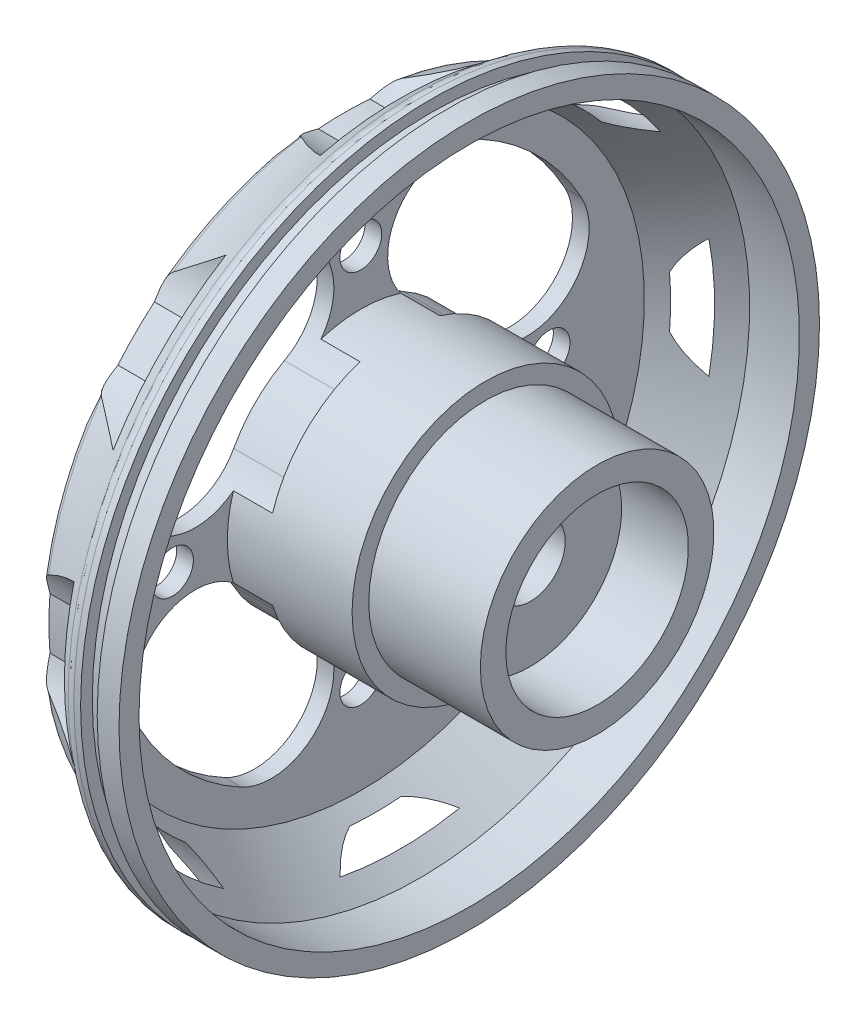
from build123d import *

# Parameters (mm, degrees)
FILLET1_R          = 1
CUT_EXTRUDE2_START = -4
CUT_EXTRUDE2_DEPTH = 4
SKETCH3_R          = 1.5
CUT_EXTRUDE3_DEPTH = 4


with BuildPart() as part:
    # Sketch1 → Revolve1 (revolve)
    with BuildSketch(Plane.XY, mode=Mode.PRIVATE) as revolve1_sk:
        with BuildLine():
            Line((13.355, 6.545), (13.355, 2.5))
            Line((13.355, 2.5), (4.784, 2.5))
            Line((4.784, 2.5), (4.784, 6.545))
            Line((4.784, 6.545), (0, 6.545))
            Line((0, 6.545), (0, 21.81504))
            ThreePointArc((0, 21.81504), (2.810772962, 23.266882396), (5.382, 25.11))
            Line((5.382, 25.11), (6.2192, 25.11))
            Line((6.2192, 25.11), (6.2192, 24.2728))
            Line((6.2192, 24.2728), (7.4092, 24.2728))
            Line((7.4092, 24.2728), (7.4092, 25.11))
            Line((7.4092, 25.11), (8.97, 25.11))
            Line((8.97, 25.11), (8.97, 23.6748))
            Line((8.97, 23.6748), (5.4, 23.6748))
            Line((5.4, 23.6748), (1.196, 20.332))
            Line((1.196, 20.332), (1.196, 9.568))
            Line((1.196, 9.568), (10.139, 9.568))
            Line((10.139, 9.568), (10.139, 8.372))
            Line((10.139, 8.372), (18.139, 8.372))
            Line((18.139, 8.372), (18.139, 6.545))
            Line((18.139, 6.545), (13.355, 6.545))
        make_face()
    revolve(revolve1_sk.sketch.rotate(Axis((0, 0, 0), (1, 0, 0)), 90), axis=Axis((0, 0, 0), (1, 0, 0)))

    # Fillet1
    fillet1_edges = [part.edges().sort_by_distance(p)[0] for p in [
        (5.382, 0, -25.11),
        (0, 0, -21.81504),
    ]]
    fillet(fillet1_edges, radius=FILLET1_R)

    # Sketch2 → Cut-Extrude2 (cut)
    with BuildSketch(Plane.ZY.offset(CUT_EXTRUDE2_START)):
        with BuildLine():
            ThreePointArc((-13.601152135, 16.217092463), (-12.594280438, 18.874157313), (-12.607387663, 21.715567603))
            ThreePointArc((-12.607387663, 21.715567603), (-17.755451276, 17.755451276), (-21.715567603, 12.607387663))
            ThreePointArc((-21.715567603, 12.607387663), (-18.874157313, 12.594280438), (-16.217092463, 13.601152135))
            ThreePointArc((-16.217092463, 13.601152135), (-14.966386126, 14.966386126), (-13.601152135, 16.217092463))
        make_face()
        with BuildLine():
            ThreePointArc((1.849749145, 21.084682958), (4.440543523, 22.251545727), (6.4404558, 24.269994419))
            ThreePointArc((6.4404558, 24.269994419), (0, 25.11), (-6.4404558, 24.269994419))
            ThreePointArc((-6.4404558, 24.269994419), (-4.440543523, 22.251545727), (-1.849749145, 21.084682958))
            ThreePointArc((-1.849749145, 21.084682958), (0, 21.165666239), (1.849749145, 21.084682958))
        make_face()
        with BuildLine():
            ThreePointArc((21.715567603, 12.607387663), (17.755451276, 17.755451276), (12.607387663, 21.715567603))
            ThreePointArc((12.607387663, 21.715567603), (12.594280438, 18.874157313), (13.601152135, 16.217092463))
            ThreePointArc((13.601152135, 16.217092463), (14.966386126, 14.966386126), (16.217092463, 13.601152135))
            ThreePointArc((16.217092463, 13.601152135), (18.874157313, 12.594280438), (21.715567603, 12.607387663))
        make_face()
        with BuildLine():
            ThreePointArc((25.11, 0), (24.899113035, 3.247502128), (24.269994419, 6.4404558))
            ThreePointArc((24.269994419, 6.4404558), (22.251545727, 4.440543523), (21.084682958, 1.849749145))
            ThreePointArc((21.084682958, 1.849749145), (21.145410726, 0.925760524), (21.165666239, 0))
            ThreePointArc((21.165666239, 0), (21.145410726, -0.925760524), (21.084682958, -1.849749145))
            ThreePointArc((21.084682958, -1.849749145), (22.251545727, -4.440543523), (24.269994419, -6.4404558))
            ThreePointArc((24.269994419, -6.4404558), (24.899113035, -3.247502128), (25.11, 0))
        make_face()
        with BuildLine():
            ThreePointArc((21.715567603, -12.607387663), (18.874157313, -12.594280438), (16.217092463, -13.601152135))
            ThreePointArc((16.217092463, -13.601152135), (14.966386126, -14.966386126), (13.601152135, -16.217092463))
            ThreePointArc((13.601152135, -16.217092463), (12.594280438, -18.874157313), (12.607387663, -21.715567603))
            ThreePointArc((12.607387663, -21.715567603), (17.755451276, -17.755451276), (21.715567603, -12.607387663))
        make_face()
        with BuildLine():
            ThreePointArc((6.4404558, -24.269994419), (4.440543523, -22.251545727), (1.849749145, -21.084682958))
            ThreePointArc((1.849749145, -21.084682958), (0, -21.165666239), (-1.849749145, -21.084682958))
            ThreePointArc((-1.849749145, -21.084682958), (-4.440543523, -22.251545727), (-6.4404558, -24.269994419))
            ThreePointArc((-6.4404558, -24.269994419), (0, -25.11), (6.4404558, -24.269994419))
        make_face()
        with BuildLine():
            ThreePointArc((-16.217092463, -13.601152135), (-18.874157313, -12.594280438), (-21.715567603, -12.607387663))
            ThreePointArc((-21.715567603, -12.607387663), (-17.755451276, -17.755451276), (-12.607387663, -21.715567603))
            ThreePointArc((-12.607387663, -21.715567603), (-12.594280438, -18.874157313), (-13.601152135, -16.217092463))
            ThreePointArc((-13.601152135, -16.217092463), (-14.966386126, -14.966386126), (-16.217092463, -13.601152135))
        make_face()
        with BuildLine():
            ThreePointArc((-21.084682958, 1.849749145), (-22.251545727, 4.440543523), (-24.269994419, 6.4404558))
            ThreePointArc((-24.269994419, 6.4404558), (-25.11, 0), (-24.269994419, -6.4404558))
            ThreePointArc((-24.269994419, -6.4404558), (-22.251545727, -4.440543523), (-21.084682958, -1.849749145))
            ThreePointArc((-21.084682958, -1.849749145), (-21.165666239, 0), (-21.084682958, 1.849749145))
        make_face()
        with BuildLine():
            ThreePointArc((-8.56954765, 15.829177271), (-12.727922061, 12.727922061), (-15.829177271, 8.56954765))
            ThreePointArc((-15.829177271, 8.56954765), (-14.014269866, 2.46986642), (-7.914588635, 4.284773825))
            ThreePointArc((-7.914588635, 4.284773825), (-6.363961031, 6.363961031), (-4.284773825, 7.914588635))
            ThreePointArc((-4.284773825, 7.914588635), (-2.46986642, 14.014269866), (-8.56954765, 15.829177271))
        make_face()
        with BuildLine():
            ThreePointArc((15.829177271, 8.56954765), (12.727922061, 12.727922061), (8.56954765, 15.829177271))
            ThreePointArc((8.56954765, 15.829177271), (2.46986642, 14.014269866), (4.284773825, 7.914588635))
            ThreePointArc((4.284773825, 7.914588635), (6.363961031, 6.363961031), (7.914588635, 4.284773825))
            ThreePointArc((7.914588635, 4.284773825), (14.014269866, 2.46986642), (15.829177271, 8.56954765))
        make_face()
        with BuildLine():
            ThreePointArc((8.56954765, -15.829177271), (12.727922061, -12.727922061), (15.829177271, -8.56954765))
            ThreePointArc((15.829177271, -8.56954765), (14.014269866, -2.46986642), (7.914588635, -4.284773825))
            ThreePointArc((7.914588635, -4.284773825), (6.363961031, -6.363961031), (4.284773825, -7.914588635))
            ThreePointArc((4.284773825, -7.914588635), (2.46986642, -14.014269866), (8.56954765, -15.829177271))
        make_face()
        with BuildLine():
            ThreePointArc((-15.829177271, -8.56954765), (-12.727922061, -12.727922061), (-8.56954765, -15.829177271))
            ThreePointArc((-8.56954765, -15.829177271), (-2.46986642, -14.014269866), (-4.284773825, -7.914588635))
            ThreePointArc((-4.284773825, -7.914588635), (-6.363961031, -6.363961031), (-7.914588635, -4.284773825))
            ThreePointArc((-7.914588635, -4.284773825), (-14.014269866, -2.46986642), (-15.829177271, -8.56954765))
        make_face()
    extrude(amount=CUT_EXTRUDE2_DEPTH, mode=Mode.SUBTRACT)

    # Sketch3 → Cut-Extrude3 (cut)
    with BuildSketch(Plane.ZY):
        with Locations((0, 13.5)):
            Circle(SKETCH3_R)
        with Locations((13.5, 0)):
            Circle(SKETCH3_R)
        with Locations((0, -13.5)):
            Circle(SKETCH3_R)
        with Locations((-13.5, 0)):
            Circle(SKETCH3_R)
    extrude(amount=-CUT_EXTRUDE3_DEPTH, mode=Mode.SUBTRACT)


solid = part.part
